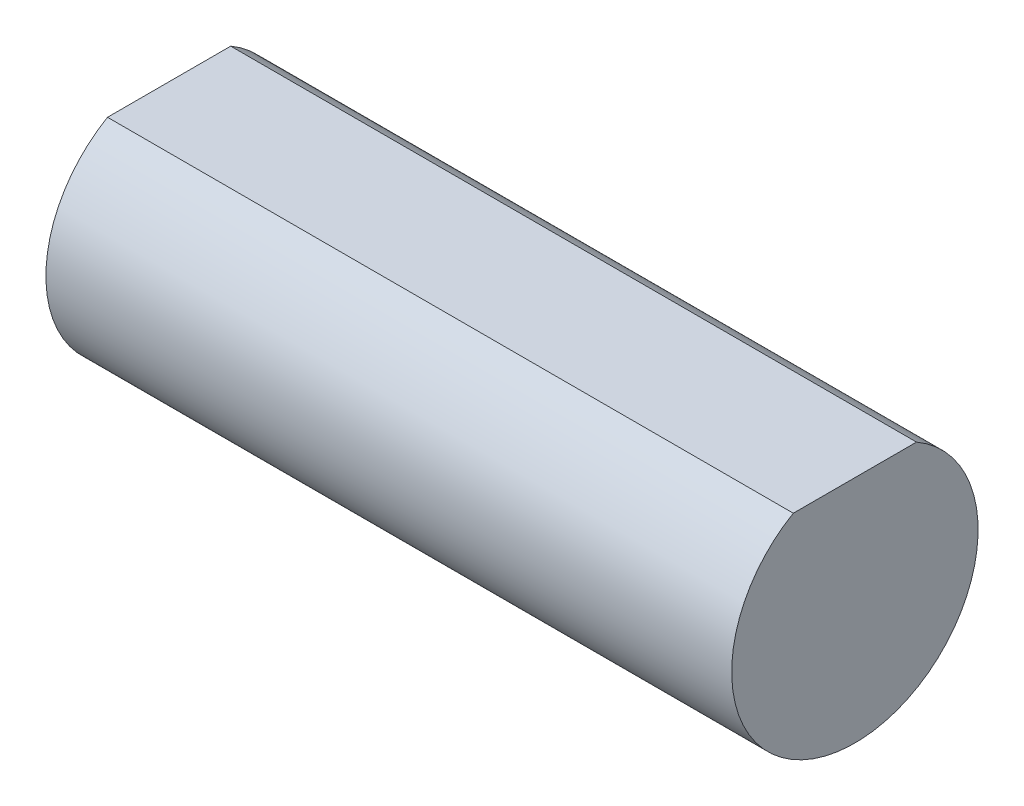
ISO-10303-21;
HEADER;
FILE_DESCRIPTION(('STEP AP214'),'2;1');
FILE_NAME('part.step','',(''),(''),'','','');
FILE_SCHEMA(('AUTOMOTIVE_DESIGN { 1 0 10303 214 1 1 1 1 }'));
ENDSEC;
DATA;
#1=APPLICATION_CONTEXT('core data for automotive mechanical design processes');
#2=APPLICATION_PROTOCOL_DEFINITION('international standard','automotive_design',2000,#1);
#3=PRODUCT_CONTEXT('',#1,'mechanical');
#4=PRODUCT('Part','Part','',(#3));
#5=PRODUCT_RELATED_PRODUCT_CATEGORY('part','',(#4));
#6=PRODUCT_DEFINITION_FORMATION('','',#4);
#7=PRODUCT_DEFINITION_CONTEXT('part definition',#1,'design');
#8=PRODUCT_DEFINITION('design','',#6,#7);
#9=PRODUCT_DEFINITION_SHAPE('','',#8);
#10=(LENGTH_UNIT() NAMED_UNIT(*) SI_UNIT(.MILLI.,.METRE.));
#11=(NAMED_UNIT(*) PLANE_ANGLE_UNIT() SI_UNIT($,.RADIAN.));
#12=(NAMED_UNIT(*) SI_UNIT($,.STERADIAN.) SOLID_ANGLE_UNIT());
#13=UNCERTAINTY_MEASURE_WITH_UNIT(LENGTH_MEASURE(1.E-05),#10,'distance_accuracy_value','');
#14=(GEOMETRIC_REPRESENTATION_CONTEXT(3) GLOBAL_UNCERTAINTY_ASSIGNED_CONTEXT((#13)) GLOBAL_UNIT_ASSIGNED_CONTEXT((#10,
#11,#12)) REPRESENTATION_CONTEXT('',''));
#15=CARTESIAN_POINT('',(0.,0.,0.));
#16=DIRECTION('',(0.,0.,1.));
#17=DIRECTION('',(1.,0.,0.));
#18=AXIS2_PLACEMENT_3D('',#15,#16,#17);
#19=CARTESIAN_POINT('',(16.7,0.,0.));
#20=DIRECTION('',(-1.,0.,0.));
#21=DIRECTION('',(0.,0.,1.));
#22=AXIS2_PLACEMENT_3D('',#19,#20,#21);
#23=CYLINDRICAL_SURFACE('',#22,3.);
#24=CARTESIAN_POINT('',(0.,0.,0.));
#25=DIRECTION('',(1.,0.,0.));
#26=DIRECTION('',(0.,0.,-1.));
#27=AXIS2_PLACEMENT_3D('',#24,#25,#26);
#28=CIRCLE('',#27,3.);
#29=CARTESIAN_POINT('',(0.,2.59807621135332,1.5));
#30=VERTEX_POINT('',#29);
#31=CARTESIAN_POINT('',(0.,2.59807621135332,-1.5));
#32=VERTEX_POINT('',#31);
#33=EDGE_CURVE('E65',#30,#32,#28,.T.);
#34=ORIENTED_EDGE('',*,*,#33,.T.);
#35=DIRECTION('',(-1.,0.,0.));
#36=VECTOR('',#35,1.);
#37=CARTESIAN_POINT('',(16.7,2.59807621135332,-1.5));
#38=LINE('',#37,#36);
#39=CARTESIAN_POINT('',(16.7,2.59807621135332,-1.5));
#40=VERTEX_POINT('',#39);
#41=EDGE_CURVE('E11',#40,#32,#38,.T.);
#42=ORIENTED_EDGE('',*,*,#41,.F.);
#43=CARTESIAN_POINT('',(16.7,0.,0.));
#44=DIRECTION('',(1.,0.,0.));
#45=DIRECTION('',(0.,0.,-1.));
#46=AXIS2_PLACEMENT_3D('',#43,#44,#45);
#47=CIRCLE('',#46,3.);
#48=CARTESIAN_POINT('',(16.7,2.59807621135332,1.5));
#49=VERTEX_POINT('',#48);
#50=EDGE_CURVE('E64',#49,#40,#47,.T.);
#51=ORIENTED_EDGE('',*,*,#50,.F.);
#52=DIRECTION('',(-1.,0.,0.));
#53=VECTOR('',#52,1.);
#54=CARTESIAN_POINT('',(16.7,2.59807621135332,1.5));
#55=LINE('',#54,#53);
#56=EDGE_CURVE('E42',#49,#30,#55,.T.);
#57=ORIENTED_EDGE('',*,*,#56,.T.);
#58=EDGE_LOOP('',(#34,#42,#51,#57));
#59=FACE_BOUND('',#58,.T.);
#60=ADVANCED_FACE('F34',(#59),#23,.T.);
#61=CARTESIAN_POINT('',(16.7,2.59807621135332,-1.5));
#62=DIRECTION('',(0.,-1.,0.));
#63=DIRECTION('',(0.,0.,-1.));
#64=AXIS2_PLACEMENT_3D('',#61,#62,#63);
#65=PLANE('',#64);
#66=DIRECTION('',(0.,0.,1.));
#67=VECTOR('',#66,1.);
#68=CARTESIAN_POINT('',(0.,2.59807621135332,-1.5));
#69=LINE('',#68,#67);
#70=EDGE_CURVE('E57',#32,#30,#69,.T.);
#71=ORIENTED_EDGE('',*,*,#70,.T.);
#72=ORIENTED_EDGE('',*,*,#56,.F.);
#73=DIRECTION('',(0.,0.,1.));
#74=VECTOR('',#73,1.);
#75=CARTESIAN_POINT('',(16.7,2.59807621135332,-1.5));
#76=LINE('',#75,#74);
#77=EDGE_CURVE('E49',#40,#49,#76,.T.);
#78=ORIENTED_EDGE('',*,*,#77,.F.);
#79=ORIENTED_EDGE('',*,*,#41,.T.);
#80=EDGE_LOOP('',(#71,#72,#78,#79));
#81=FACE_BOUND('',#80,.T.);
#82=ADVANCED_FACE('F60',(#81),#65,.F.);
#83=CARTESIAN_POINT('',(16.7,0.,0.));
#84=DIRECTION('',(1.,0.,0.));
#85=DIRECTION('',(0.,0.,-1.));
#86=AXIS2_PLACEMENT_3D('',#83,#84,#85);
#87=PLANE('',#86);
#88=ORIENTED_EDGE('',*,*,#50,.T.);
#89=ORIENTED_EDGE('',*,*,#77,.T.);
#90=EDGE_LOOP('',(#88,#89));
#91=FACE_BOUND('',#90,.T.);
#92=ADVANCED_FACE('F72',(#91),#87,.T.);
#93=CARTESIAN_POINT('',(0.,0.,0.));
#94=DIRECTION('',(1.,0.,0.));
#95=DIRECTION('',(0.,0.,-1.));
#96=AXIS2_PLACEMENT_3D('',#93,#94,#95);
#97=PLANE('',#96);
#98=ORIENTED_EDGE('',*,*,#33,.F.);
#99=ORIENTED_EDGE('',*,*,#70,.F.);
#100=EDGE_LOOP('',(#98,#99));
#101=FACE_BOUND('',#100,.T.);
#102=ADVANCED_FACE('F68',(#101),#97,.F.);
#103=CLOSED_SHELL('',(#60,#82,#92,#102));
#104=MANIFOLD_SOLID_BREP('B2',#103);
#105=ADVANCED_BREP_SHAPE_REPRESENTATION('',(#18,#104),#14);
#106=SHAPE_DEFINITION_REPRESENTATION(#9,#105);
ENDSEC;
END-ISO-10303-21;
